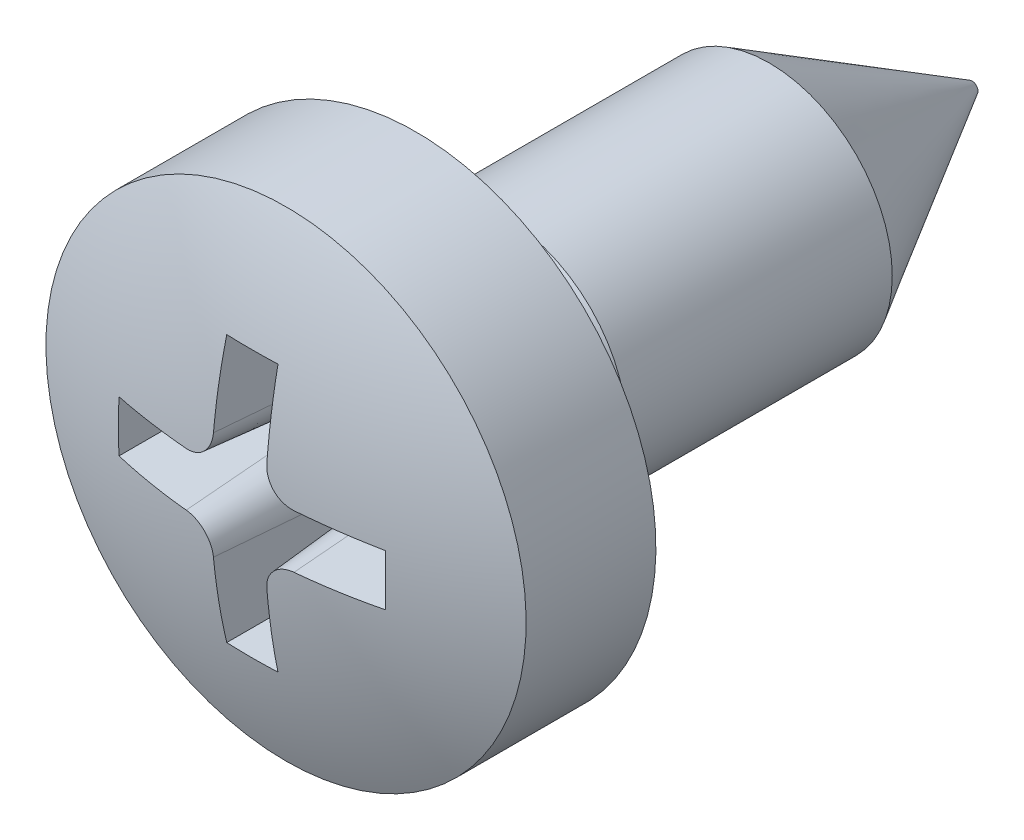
from build123d import *

# Parameters (mm, degrees)
KREUZSCHLITZ_DEPTH = 2.7
KREUZSCHLITZ_DRAFT = -4.999999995


with BuildPart() as part:
    # Skizze1 → Grundk_rper (revolve)
    with BuildSketch(Plane(origin=(0, 0, 0), x_dir=(0, 0, -1), z_dir=(1, 0, 0)), mode=Mode.PRIVATE) as grundk_rper_sk:
        with BuildLine():
            Line((-2.216436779, 4.1), (0, 4.1))
            Line((0, 4.1), (0, 1.5705))
            Line((0, 1.5705), (1.5, 2.1))
            Line((1.5, 2.1), (6.035898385, 2.1))
            Line((6.035898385, 2.1), (9.5, 0.1))
            Line((9.5, 0.1), (9.5, 0))
            Line((9.5, 0), (-3.05, 0))
            ThreePointArc((-3.05, 0), (-2.839499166, 2.091938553), (-2.216436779, 4.1))
        make_face()
    revolve(grundk_rper_sk.sketch.rotate(Axis((0, 0, 23.761014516), (0, 0, -1)), 180), axis=Axis((0, 0, 23.761014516), (0, 0, -1)))


with BuildPart() as kreuzschlitz_tool:
    # Skizze2 → Kreuzschlitz (with draft: the straight prism first)
    with BuildSketch(Plane.XY.offset(3.05)):
        with BuildLine():
            Line((-0.46, 2.3), (-0.46, 0.92))
            ThreePointArc((-0.46, 0.92), (-0.594730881, 0.594730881), (-0.92, 0.46))
            Line((-0.92, 0.46), (-2.3, 0.46))
            Line((-2.3, 0.46), (-2.3, -0.46))
            Line((-2.3, -0.46), (-0.92, -0.46))
            ThreePointArc((-0.92, -0.46), (-0.594730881, -0.594730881), (-0.46, -0.92))
            Line((-0.46, -0.92), (-0.46, -2.3))
            Line((-0.46, -2.3), (0.46, -2.3))
            Line((0.46, -2.3), (0.46, -0.92))
            ThreePointArc((0.46, -0.92), (0.594730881, -0.594730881), (0.92, -0.46))
            Line((0.92, -0.46), (2.3, -0.46))
            Line((2.3, -0.46), (2.3, 0.46))
            Line((2.3, 0.46), (0.92, 0.46))
            ThreePointArc((0.92, 0.46), (0.594730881, 0.594730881), (0.46, 0.92))
            Line((0.46, 0.92), (0.46, 2.3))
            Line((0.46, 2.3), (-0.46, 2.3))
        make_face()
    extrude(amount=-KREUZSCHLITZ_DEPTH)
    # Kreuzschlitz: the draft: its side faces are tilted about the plane it starts from
    kreuzschlitz_sides = [kreuzschlitz_tool.faces().sort_by_distance(p)[0] for p in [
        (0.46, 1.61, 1.7),
        (0, 2.3, 1.7),
        (-0.46, 1.61, 1.7),
        (-0.594730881, 0.594730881, 1.7),
        (-1.61, 0.46, 1.7),
        (-2.3, 0, 1.7),
        (-1.61, -0.46, 1.7),
        (-0.594730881, -0.594730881, 1.7),
        (-0.46, -1.61, 1.7),
        (0, -2.3, 1.7),
        (0.46, -1.61, 1.7),
        (0.594730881, -0.594730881, 1.7),
        (1.61, -0.46, 1.7),
        (2.3, 0, 1.7),
        (1.61, 0.46, 1.7),
        (0.594730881, 0.594730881, 1.7),
    ]]
    draft(kreuzschlitz_sides, Plane.XY.offset(3.05), KREUZSCHLITZ_DRAFT)


with BuildPart() as part_1:
    add(part.part)

    # Kreuzschlitz: cut by kreuzschlitz_tool
    add(kreuzschlitz_tool.part, mode=Mode.SUBTRACT)


solid = part_1.part
